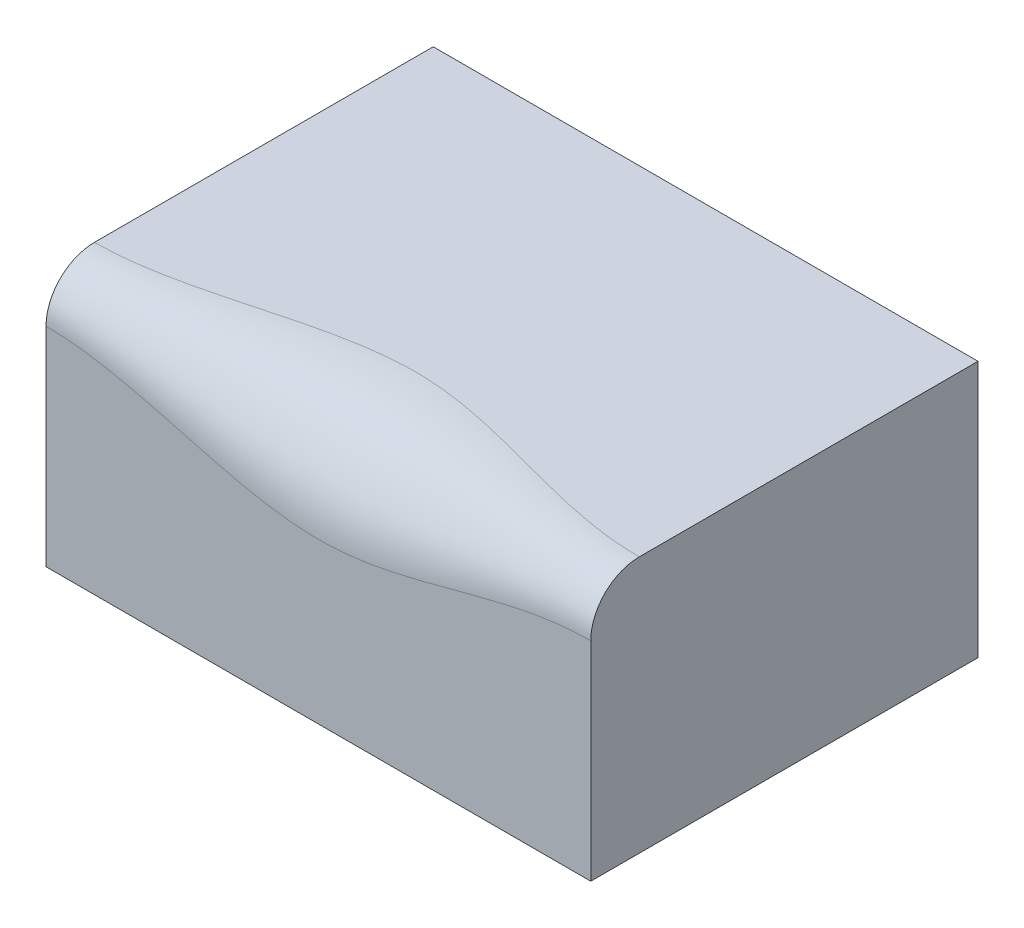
ISO-10303-21;
HEADER;
FILE_DESCRIPTION(('STEP AP214'),'2;1');
FILE_NAME('part.step','',(''),(''),'','','');
FILE_SCHEMA(('AUTOMOTIVE_DESIGN { 1 0 10303 214 1 1 1 1 }'));
ENDSEC;
DATA;
#1=APPLICATION_CONTEXT('core data for automotive mechanical design processes');
#2=APPLICATION_PROTOCOL_DEFINITION('international standard','automotive_design',2000,#1);
#3=PRODUCT_CONTEXT('',#1,'mechanical');
#4=PRODUCT('Part','Part','',(#3));
#5=PRODUCT_RELATED_PRODUCT_CATEGORY('part','',(#4));
#6=PRODUCT_DEFINITION_FORMATION('','',#4);
#7=PRODUCT_DEFINITION_CONTEXT('part definition',#1,'design');
#8=PRODUCT_DEFINITION('design','',#6,#7);
#9=PRODUCT_DEFINITION_SHAPE('','',#8);
#10=(LENGTH_UNIT() NAMED_UNIT(*) SI_UNIT(.MILLI.,.METRE.));
#11=(NAMED_UNIT(*) PLANE_ANGLE_UNIT() SI_UNIT($,.RADIAN.));
#12=(NAMED_UNIT(*) SI_UNIT($,.STERADIAN.) SOLID_ANGLE_UNIT());
#13=UNCERTAINTY_MEASURE_WITH_UNIT(LENGTH_MEASURE(1.E-05),#10,'distance_accuracy_value','');
#14=(GEOMETRIC_REPRESENTATION_CONTEXT(3) GLOBAL_UNCERTAINTY_ASSIGNED_CONTEXT((#13)) GLOBAL_UNIT_ASSIGNED_CONTEXT((#10,
#11,#12)) REPRESENTATION_CONTEXT('',''));
#15=CARTESIAN_POINT('',(0.,0.,0.));
#16=DIRECTION('',(0.,0.,1.));
#17=DIRECTION('',(1.,0.,0.));
#18=AXIS2_PLACEMENT_3D('',#15,#16,#17);
#19=CARTESIAN_POINT('',(0.,67.31,0.));
#20=DIRECTION('',(1.,0.,0.));
#21=DIRECTION('',(0.,0.,-1.));
#22=AXIS2_PLACEMENT_3D('',#19,#20,#21);
#23=PLANE('',#22);
#24=DIRECTION('',(0.,-1.,0.));
#25=VECTOR('',#24,1.);
#26=CARTESIAN_POINT('',(0.,67.31,0.));
#27=LINE('',#26,#25);
#28=CARTESIAN_POINT('',(0.,54.61,0.));
#29=VERTEX_POINT('',#28);
#30=CARTESIAN_POINT('',(0.,0.,0.));
#31=VERTEX_POINT('',#30);
#32=EDGE_CURVE('E122',#29,#31,#27,.T.);
#33=ORIENTED_EDGE('',*,*,#32,.F.);
#34=CARTESIAN_POINT('',(0.,54.61,0.));
#35=CARTESIAN_POINT('',(0.,54.9672009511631,3.84095411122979E-05));
#36=CARTESIAN_POINT('',(0.,55.3243963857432,-0.0150683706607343));
#37=CARTESIAN_POINT('',(0.,56.0362316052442,-0.0752948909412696));
#38=CARTESIAN_POINT('',(0.,56.3908715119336,-0.120413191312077));
#39=CARTESIAN_POINT('',(0.,57.0948197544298,-0.240340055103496));
#40=CARTESIAN_POINT('',(0.,57.4441319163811,-0.315126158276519));
#41=CARTESIAN_POINT('',(0.,58.1352139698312,-0.493844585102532));
#42=CARTESIAN_POINT('',(0.,58.4769839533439,-0.597776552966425));
#43=CARTESIAN_POINT('',(0.,59.150722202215,-0.834109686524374));
#44=CARTESIAN_POINT('',(0.,59.4826856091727,-0.966524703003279));
#45=CARTESIAN_POINT('',(0.,60.1342763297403,-1.25885162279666));
#46=CARTESIAN_POINT('',(0.,60.4539036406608,-1.41876353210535));
#47=CARTESIAN_POINT('',(0.,61.0784950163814,-1.76491725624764));
#48=CARTESIAN_POINT('',(0.,61.3834616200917,-1.95115448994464));
#49=CARTESIAN_POINT('',(0.,61.976621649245,-2.34865486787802));
#50=CARTESIAN_POINT('',(0.,62.2648151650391,-2.5599178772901));
#51=CARTESIAN_POINT('',(0.,62.8223795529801,-3.0059667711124));
#52=CARTESIAN_POINT('',(0.,63.0917506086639,-3.24075242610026));
#53=CARTESIAN_POINT('',(0.,63.6097598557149,-3.73218074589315));
#54=CARTESIAN_POINT('',(0.,63.8583979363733,-3.98882352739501));
#55=CARTESIAN_POINT('',(0.,64.3332200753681,-4.52219456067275));
#56=CARTESIAN_POINT('',(0.,64.5593996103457,-4.79892683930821));
#57=CARTESIAN_POINT('',(0.,64.9876361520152,-5.37045869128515));
#58=CARTESIAN_POINT('',(0.,65.1896935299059,-5.66525798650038));
#59=CARTESIAN_POINT('',(0.,65.5682909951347,-6.27089328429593));
#60=CARTESIAN_POINT('',(0.,65.7448259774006,-6.5817324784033));
#61=CARTESIAN_POINT('',(0.,66.0710757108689,-7.21718020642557));
#62=CARTESIAN_POINT('',(0.,66.2207902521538,-7.5417888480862));
#63=CARTESIAN_POINT('',(0.,66.4922697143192,-8.20232520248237));
#64=CARTESIAN_POINT('',(0.,66.6140477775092,-8.53824750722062));
#65=CARTESIAN_POINT('',(0.,66.8288482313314,-9.21902333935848));
#66=CARTESIAN_POINT('',(0.,66.9218775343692,-9.56387469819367));
#67=CARTESIAN_POINT('',(0.,67.1031202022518,-10.3694565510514));
#68=CARTESIAN_POINT('',(0.,67.1806975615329,-10.8326492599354));
#69=CARTESIAN_POINT('',(0.,67.2582663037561,-11.5311246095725));
#70=CARTESIAN_POINT('',(0.,67.2776563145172,-11.7644291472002));
#71=CARTESIAN_POINT('',(0.,67.3035233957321,-12.231803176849));
#72=CARTESIAN_POINT('',(0.,67.3099977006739,-12.4658728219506));
#73=CARTESIAN_POINT('',(0.,67.31,-12.7));
#74=B_SPLINE_CURVE_WITH_KNOTS('',3,(#34,#35,#36,#37,#38,#39,#40,#41,#42,#43,#44,#45,#46,#47,#48,
#49,#50,#51,#52,#53,#54,#55,#56,#57,#58,#59,#60,#61,#62,#63,#64,#65,#66,#67,#68,#69,#70,#71,#72,
#73),.UNSPECIFIED.,.F.,.F.,(4,2,2,2,2,2,2,2,2,2,2,2,2,2,2,2,2,2,2,4),(0.,1.07127576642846,
2.14250014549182,3.21291508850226,4.28331696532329,5.35424054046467,6.42516434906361,
7.49590202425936,8.56663393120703,9.6373553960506,10.7080825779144,11.7790249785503,
12.8499508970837,13.9210907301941,14.9922389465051,16.062882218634,17.1332678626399,
18.5389324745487,19.2409593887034,19.943136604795),.UNSPECIFIED.);
#75=CARTESIAN_POINT('',(0.,67.31,-12.7));
#76=VERTEX_POINT('',#75);
#77=EDGE_CURVE('E12',#29,#76,#74,.T.);
#78=ORIENTED_EDGE('',*,*,#77,.T.);
#79=DIRECTION('',(0.,0.,1.));
#80=VECTOR('',#79,1.);
#81=CARTESIAN_POINT('',(0.,67.31,0.));
#82=LINE('',#81,#80);
#83=CARTESIAN_POINT('',(0.,67.31,-101.537865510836));
#84=VERTEX_POINT('',#83);
#85=EDGE_CURVE('E93',#84,#76,#82,.T.);
#86=ORIENTED_EDGE('',*,*,#85,.F.);
#87=DIRECTION('',(0.,-1.,0.));
#88=VECTOR('',#87,1.);
#89=CARTESIAN_POINT('',(0.,67.31,-101.537865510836));
#90=LINE('',#89,#88);
#91=CARTESIAN_POINT('',(0.,0.,-101.537865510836));
#92=VERTEX_POINT('',#91);
#93=EDGE_CURVE('E103',#84,#92,#90,.T.);
#94=ORIENTED_EDGE('',*,*,#93,.T.);
#95=DIRECTION('',(0.,0.,1.));
#96=VECTOR('',#95,1.);
#97=CARTESIAN_POINT('',(0.,0.,0.));
#98=LINE('',#97,#96);
#99=EDGE_CURVE('E112',#92,#31,#98,.T.);
#100=ORIENTED_EDGE('',*,*,#99,.T.);
#101=EDGE_LOOP('',(#33,#78,#86,#94,#100));
#102=FACE_BOUND('',#101,.T.);
#103=ADVANCED_FACE('F34',(#102),#23,.F.);
#104=CARTESIAN_POINT('',(0.,67.31,0.));
#105=DIRECTION('',(0.,0.,-1.));
#106=DIRECTION('',(-1.,0.,0.));
#107=AXIS2_PLACEMENT_3D('',#104,#105,#106);
#108=PLANE('',#107);
#109=DIRECTION('',(0.,-1.,0.));
#110=VECTOR('',#109,1.);
#111=CARTESIAN_POINT('',(142.851266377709,67.31,0.));
#112=LINE('',#111,#110);
#113=CARTESIAN_POINT('',(142.851266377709,54.61,0.));
#114=VERTEX_POINT('',#113);
#115=CARTESIAN_POINT('',(142.851266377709,0.,0.));
#116=VERTEX_POINT('',#115);
#117=EDGE_CURVE('E102',#114,#116,#112,.T.);
#118=ORIENTED_EDGE('',*,*,#117,.F.);
#119=CARTESIAN_POINT('',(-285.702532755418,54.61,0.));
#120=CARTESIAN_POINT('',(-190.468355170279,54.61,0.));
#121=CARTESIAN_POINT('',(-95.2341775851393,54.61,0.));
#122=CARTESIAN_POINT('',(0.,54.61,0.));
#123=CARTESIAN_POINT('',(23.8085443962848,54.61,0.));
#124=CARTESIAN_POINT('',(47.6170887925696,41.91,0.));
#125=CARTESIAN_POINT('',(71.4256331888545,41.91,0.));
#126=CARTESIAN_POINT('',(95.2341775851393,41.91,0.));
#127=CARTESIAN_POINT('',(119.042721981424,54.61,0.));
#128=CARTESIAN_POINT('',(142.851266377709,54.61,0.));
#129=CARTESIAN_POINT('',(238.085443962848,54.61,0.));
#130=CARTESIAN_POINT('',(333.319621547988,54.61,0.));
#131=CARTESIAN_POINT('',(428.553799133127,54.61,0.));
#132=(BOUNDED_CURVE() B_SPLINE_CURVE(3,(#119,#120,#121,#122,#123,#124,#125,#126,#127,#128,#129,
#130,#131),.UNSPECIFIED.,.F.,.F.) B_SPLINE_CURVE_WITH_KNOTS((4,3,3,3,4),(0.,0.4,0.5,0.6,1.),
.UNSPECIFIED.) CURVE() GEOMETRIC_REPRESENTATION_ITEM() RATIONAL_B_SPLINE_CURVE((1.,1.,1.,1.,1.,
1.,1.,1.,1.,1.,1.,1.,1.)) REPRESENTATION_ITEM(''));
#133=EDGE_CURVE('E48',#114,#29,#132,.F.);
#134=ORIENTED_EDGE('',*,*,#133,.T.);
#135=ORIENTED_EDGE('',*,*,#32,.T.);
#136=DIRECTION('',(1.,0.,0.));
#137=VECTOR('',#136,1.);
#138=CARTESIAN_POINT('',(0.,0.,0.));
#139=LINE('',#138,#137);
#140=EDGE_CURVE('E115',#31,#116,#139,.T.);
#141=ORIENTED_EDGE('',*,*,#140,.T.);
#142=EDGE_LOOP('',(#118,#134,#135,#141));
#143=FACE_BOUND('',#142,.T.);
#144=ADVANCED_FACE('F140',(#143),#108,.F.);
#145=CARTESIAN_POINT('',(142.851266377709,67.31,0.));
#146=DIRECTION('',(-1.,0.,0.));
#147=DIRECTION('',(0.,0.,1.));
#148=AXIS2_PLACEMENT_3D('',#145,#146,#147);
#149=PLANE('',#148);
#150=DIRECTION('',(0.,0.,-1.));
#151=VECTOR('',#150,1.);
#152=CARTESIAN_POINT('',(142.851266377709,67.31,0.));
#153=LINE('',#152,#151);
#154=CARTESIAN_POINT('',(142.851266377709,67.31,-12.7));
#155=VERTEX_POINT('',#154);
#156=CARTESIAN_POINT('',(142.851266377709,67.31,-101.537865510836));
#157=VERTEX_POINT('',#156);
#158=EDGE_CURVE('E84',#155,#157,#153,.T.);
#159=ORIENTED_EDGE('',*,*,#158,.F.);
#160=CARTESIAN_POINT('',(142.851266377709,67.31,-12.7));
#161=CARTESIAN_POINT('',(142.851266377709,67.3100384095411,-12.3427990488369));
#162=CARTESIAN_POINT('',(142.851266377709,67.2949316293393,-11.9856036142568));
#163=CARTESIAN_POINT('',(142.851266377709,67.2347051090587,-11.2737683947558));
#164=CARTESIAN_POINT('',(142.851266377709,67.1895868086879,-10.9191284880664));
#165=CARTESIAN_POINT('',(142.851266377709,67.0696599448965,-10.2151802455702));
#166=CARTESIAN_POINT('',(142.851266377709,66.9948738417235,-9.86586808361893));
#167=CARTESIAN_POINT('',(142.851266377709,66.8161554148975,-9.17478603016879));
#168=CARTESIAN_POINT('',(142.851266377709,66.7122234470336,-8.83301604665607));
#169=CARTESIAN_POINT('',(142.851266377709,66.4758903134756,-8.15927779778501));
#170=CARTESIAN_POINT('',(142.851266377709,66.3434752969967,-7.82731439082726));
#171=CARTESIAN_POINT('',(142.851266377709,66.0511483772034,-7.17572367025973));
#172=CARTESIAN_POINT('',(142.851266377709,65.8912364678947,-6.85609635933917));
#173=CARTESIAN_POINT('',(142.851266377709,65.5450827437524,-6.23150498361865));
#174=CARTESIAN_POINT('',(142.851266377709,65.3588455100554,-5.92653837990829));
#175=CARTESIAN_POINT('',(142.851266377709,64.961345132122,-5.33337835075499));
#176=CARTESIAN_POINT('',(142.851266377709,64.7500821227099,-5.0451848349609));
#177=CARTESIAN_POINT('',(142.851266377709,64.3040332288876,-4.48762044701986));
#178=CARTESIAN_POINT('',(142.851266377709,64.0692475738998,-4.21824939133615));
#179=CARTESIAN_POINT('',(142.851266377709,63.5778192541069,-3.70024014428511));
#180=CARTESIAN_POINT('',(142.851266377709,63.321176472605,-3.45160206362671));
#181=CARTESIAN_POINT('',(142.851266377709,62.7878054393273,-2.97677992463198));
#182=CARTESIAN_POINT('',(142.851266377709,62.5110731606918,-2.7506003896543));
#183=CARTESIAN_POINT('',(142.851266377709,61.9395413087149,-2.32236384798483));
#184=CARTESIAN_POINT('',(142.851266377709,61.6447420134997,-2.12030647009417));
#185=CARTESIAN_POINT('',(142.851266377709,61.0391067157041,-1.74170900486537));
#186=CARTESIAN_POINT('',(142.851266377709,60.7282675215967,-1.56517402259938));
#187=CARTESIAN_POINT('',(142.851266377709,60.0928197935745,-1.23892428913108));
#188=CARTESIAN_POINT('',(142.851266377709,59.7682111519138,-1.08920974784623));
#189=CARTESIAN_POINT('',(142.851266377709,59.1076747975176,-0.817730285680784));
#190=CARTESIAN_POINT('',(142.851266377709,58.7717524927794,-0.695952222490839));
#191=CARTESIAN_POINT('',(142.851266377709,58.0909766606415,-0.481151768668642));
#192=CARTESIAN_POINT('',(142.851266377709,57.7461253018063,-0.388122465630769));
#193=CARTESIAN_POINT('',(142.851266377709,56.9405434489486,-0.206879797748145));
#194=CARTESIAN_POINT('',(142.851266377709,56.4773507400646,-0.129302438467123));
#195=CARTESIAN_POINT('',(142.851266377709,55.7788753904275,-0.0517336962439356));
#196=CARTESIAN_POINT('',(142.851266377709,55.5455708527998,-0.0323436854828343));
#197=CARTESIAN_POINT('',(142.851266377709,55.078196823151,-0.00647660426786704));
#198=CARTESIAN_POINT('',(142.851266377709,54.8441271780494,-2.29932605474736E-06));
#199=CARTESIAN_POINT('',(142.851266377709,54.61,0.));
#200=B_SPLINE_CURVE_WITH_KNOTS('',3,(#160,#161,#162,#163,#164,#165,#166,#167,#168,#169,#170,
#171,#172,#173,#174,#175,#176,#177,#178,#179,#180,#181,#182,#183,#184,#185,#186,#187,#188,#189,
#190,#191,#192,#193,#194,#195,#196,#197,#198,#199),.UNSPECIFIED.,.F.,.F.,(4,2,2,2,2,2,2,2,2,2,2,
2,2,2,2,2,2,2,2,4),(0.,1.07127576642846,2.14250014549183,3.21291508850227,4.2833169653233,
5.35424054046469,6.42516434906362,7.49590202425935,8.56663393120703,9.63735539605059,
10.7080825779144,11.7790249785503,12.8499508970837,13.9210907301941,14.9922389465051,
16.062882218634,17.13326786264,18.5389324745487,19.2409593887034,19.943136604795),.UNSPECIFIED.);
#201=EDGE_CURVE('E62',#155,#114,#200,.T.);
#202=ORIENTED_EDGE('',*,*,#201,.T.);
#203=ORIENTED_EDGE('',*,*,#117,.T.);
#204=DIRECTION('',(0.,0.,-1.));
#205=VECTOR('',#204,1.);
#206=CARTESIAN_POINT('',(142.851266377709,0.,0.));
#207=LINE('',#206,#205);
#208=CARTESIAN_POINT('',(142.851266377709,0.,-101.537865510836));
#209=VERTEX_POINT('',#208);
#210=EDGE_CURVE('E99',#116,#209,#207,.T.);
#211=ORIENTED_EDGE('',*,*,#210,.T.);
#212=DIRECTION('',(0.,-1.,0.));
#213=VECTOR('',#212,1.);
#214=CARTESIAN_POINT('',(142.851266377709,67.31,-101.537865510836));
#215=LINE('',#214,#213);
#216=EDGE_CURVE('E96',#157,#209,#215,.T.);
#217=ORIENTED_EDGE('',*,*,#216,.F.);
#218=EDGE_LOOP('',(#159,#202,#203,#211,#217));
#219=FACE_BOUND('',#218,.T.);
#220=ADVANCED_FACE('F97',(#219),#149,.F.);
#221=CARTESIAN_POINT('',(0.,67.31,-101.537865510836));
#222=DIRECTION('',(0.,0.,1.));
#223=DIRECTION('',(1.,0.,0.));
#224=AXIS2_PLACEMENT_3D('',#221,#222,#223);
#225=PLANE('',#224);
#226=DIRECTION('',(-1.,0.,0.));
#227=VECTOR('',#226,1.);
#228=CARTESIAN_POINT('',(0.,0.,-101.537865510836));
#229=LINE('',#228,#227);
#230=EDGE_CURVE('E119',#209,#92,#229,.T.);
#231=ORIENTED_EDGE('',*,*,#230,.T.);
#232=ORIENTED_EDGE('',*,*,#93,.F.);
#233=DIRECTION('',(-1.,0.,0.));
#234=VECTOR('',#233,1.);
#235=CARTESIAN_POINT('',(0.,67.31,-101.537865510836));
#236=LINE('',#235,#234);
#237=EDGE_CURVE('E89',#157,#84,#236,.T.);
#238=ORIENTED_EDGE('',*,*,#237,.F.);
#239=ORIENTED_EDGE('',*,*,#216,.T.);
#240=EDGE_LOOP('',(#231,#232,#238,#239));
#241=FACE_BOUND('',#240,.T.);
#242=ADVANCED_FACE('F105',(#241),#225,.F.);
#243=CARTESIAN_POINT('',(0.,67.31,-101.537865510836));
#244=DIRECTION('',(0.,-1.,0.));
#245=DIRECTION('',(0.,0.,-1.));
#246=AXIS2_PLACEMENT_3D('',#243,#244,#245);
#247=PLANE('',#246);
#248=ORIENTED_EDGE('',*,*,#85,.T.);
#249=CARTESIAN_POINT('',(-285.702532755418,67.31,-12.7));
#250=CARTESIAN_POINT('',(-190.468355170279,67.31,-12.7));
#251=CARTESIAN_POINT('',(-95.2341775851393,67.31,-12.7));
#252=CARTESIAN_POINT('',(0.,67.31,-12.7));
#253=CARTESIAN_POINT('',(23.8085443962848,67.31,-12.7));
#254=CARTESIAN_POINT('',(47.6170887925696,67.31,-25.4));
#255=CARTESIAN_POINT('',(71.4256331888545,67.31,-25.4));
#256=CARTESIAN_POINT('',(95.2341775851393,67.31,-25.4));
#257=CARTESIAN_POINT('',(119.042721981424,67.31,-12.7));
#258=CARTESIAN_POINT('',(142.851266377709,67.31,-12.7));
#259=CARTESIAN_POINT('',(238.085443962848,67.31,-12.7));
#260=CARTESIAN_POINT('',(333.319621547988,67.31,-12.7));
#261=CARTESIAN_POINT('',(428.553799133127,67.31,-12.7));
#262=(BOUNDED_CURVE() B_SPLINE_CURVE(3,(#249,#250,#251,#252,#253,#254,#255,#256,#257,#258,#259,
#260,#261),.UNSPECIFIED.,.F.,.F.) B_SPLINE_CURVE_WITH_KNOTS((4,3,3,3,4),(0.,0.4,0.5,0.6,1.),
.UNSPECIFIED.) CURVE() GEOMETRIC_REPRESENTATION_ITEM() RATIONAL_B_SPLINE_CURVE((1.,1.,1.,1.,1.,
1.,1.,1.,1.,1.,1.,1.,1.)) REPRESENTATION_ITEM(''));
#263=EDGE_CURVE('E92',#76,#155,#262,.T.);
#264=ORIENTED_EDGE('',*,*,#263,.T.);
#265=ORIENTED_EDGE('',*,*,#158,.T.);
#266=ORIENTED_EDGE('',*,*,#237,.T.);
#267=EDGE_LOOP('',(#248,#264,#265,#266));
#268=FACE_BOUND('',#267,.T.);
#269=ADVANCED_FACE('F87',(#268),#247,.F.);
#270=CARTESIAN_POINT('',(0.,0.,-101.537865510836));
#271=DIRECTION('',(0.,-1.,0.));
#272=DIRECTION('',(0.,0.,-1.));
#273=AXIS2_PLACEMENT_3D('',#270,#271,#272);
#274=PLANE('',#273);
#275=ORIENTED_EDGE('',*,*,#99,.F.);
#276=ORIENTED_EDGE('',*,*,#230,.F.);
#277=ORIENTED_EDGE('',*,*,#210,.F.);
#278=ORIENTED_EDGE('',*,*,#140,.F.);
#279=EDGE_LOOP('',(#275,#276,#277,#278));
#280=FACE_BOUND('',#279,.T.);
#281=ADVANCED_FACE('F153',(#280),#274,.T.);
#282=CARTESIAN_POINT('',(-28.5702532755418,67.31,-12.7));
#283=CARTESIAN_POINT('',(-19.0468355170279,67.31,-12.7));
#284=CARTESIAN_POINT('',(-9.52341775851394,67.31,-12.7));
#285=CARTESIAN_POINT('',(0.,67.31,-12.7));
#286=CARTESIAN_POINT('',(23.8085443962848,67.31,-12.7));
#287=CARTESIAN_POINT('',(47.6170887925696,67.31,-25.4));
#288=CARTESIAN_POINT('',(71.4256331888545,67.31,-25.4));
#289=CARTESIAN_POINT('',(95.2341775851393,67.31,-25.4));
#290=CARTESIAN_POINT('',(119.042721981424,67.31,-12.7));
#291=CARTESIAN_POINT('',(142.851266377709,67.31,-12.7));
#292=CARTESIAN_POINT('',(152.374684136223,67.31,-12.7));
#293=CARTESIAN_POINT('',(161.898101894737,67.31,-12.7));
#294=CARTESIAN_POINT('',(171.421519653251,67.31,-12.7));
#295=CARTESIAN_POINT('',(-28.5702532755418,67.31,0.));
#296=CARTESIAN_POINT('',(-19.0468355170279,67.31,0.));
#297=CARTESIAN_POINT('',(-9.52341775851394,67.31,0.));
#298=CARTESIAN_POINT('',(0.,67.31,0.));
#299=CARTESIAN_POINT('',(23.8085443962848,67.31,0.));
#300=CARTESIAN_POINT('',(47.6170887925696,67.31,0.));
#301=CARTESIAN_POINT('',(71.4256331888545,67.31,0.));
#302=CARTESIAN_POINT('',(95.2341775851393,67.31,0.));
#303=CARTESIAN_POINT('',(119.042721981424,67.31,0.));
#304=CARTESIAN_POINT('',(142.851266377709,67.31,0.));
#305=CARTESIAN_POINT('',(152.374684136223,67.31,0.));
#306=CARTESIAN_POINT('',(161.898101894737,67.31,0.));
#307=CARTESIAN_POINT('',(171.421519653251,67.31,0.));
#308=CARTESIAN_POINT('',(-28.5702532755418,54.61,0.));
#309=CARTESIAN_POINT('',(-19.0468355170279,54.61,0.));
#310=CARTESIAN_POINT('',(-9.52341775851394,54.61,0.));
#311=CARTESIAN_POINT('',(0.,54.61,0.));
#312=CARTESIAN_POINT('',(23.8085443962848,54.61,0.));
#313=CARTESIAN_POINT('',(47.6170887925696,41.91,0.));
#314=CARTESIAN_POINT('',(71.4256331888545,41.91,0.));
#315=CARTESIAN_POINT('',(95.2341775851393,41.91,0.));
#316=CARTESIAN_POINT('',(119.042721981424,54.61,0.));
#317=CARTESIAN_POINT('',(142.851266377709,54.61,0.));
#318=CARTESIAN_POINT('',(152.374684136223,54.61,0.));
#319=CARTESIAN_POINT('',(161.898101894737,54.61,0.));
#320=CARTESIAN_POINT('',(171.421519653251,54.61,0.));
#321=(BOUNDED_SURFACE() B_SPLINE_SURFACE(2,3,((#282,#283,#284,#285,#286,#287,#288,#289,#290,
#291,#292,#293,#294),(#295,#296,#297,#298,#299,#300,#301,#302,#303,#304,#305,#306,#307),(#308,
#309,#310,#311,#312,#313,#314,#315,#316,#317,#318,#319,#320)),.UNSPECIFIED.,.F.,.F.,
.F.) B_SPLINE_SURFACE_WITH_KNOTS((3,3),(4,3,3,3,4),(0.,1.),(0.36,0.4,0.5,0.6,0.64),
.UNSPECIFIED.) GEOMETRIC_REPRESENTATION_ITEM() RATIONAL_B_SPLINE_SURFACE(((1.,1.,1.,1.,1.,1.,1.,
1.,1.,1.,1.,1.,1.),(0.707106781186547,0.707106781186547,0.707106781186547,0.707106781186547,
0.707106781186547,0.707106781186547,0.707106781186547,0.707106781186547,0.707106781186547,
0.707106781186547,0.707106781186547,0.707106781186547,0.707106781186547),(1.,1.,1.,1.,1.,1.,1.,
1.,1.,1.,1.,1.,1.))) REPRESENTATION_ITEM('') SURFACE());
#322=ORIENTED_EDGE('',*,*,#77,.F.);
#323=ORIENTED_EDGE('',*,*,#133,.F.);
#324=ORIENTED_EDGE('',*,*,#201,.F.);
#325=ORIENTED_EDGE('',*,*,#263,.F.);
#326=EDGE_LOOP('',(#322,#323,#324,#325));
#327=FACE_BOUND('',#326,.T.);
#328=ADVANCED_FACE('F36',(#327),#321,.T.);
#329=CLOSED_SHELL('',(#103,#144,#220,#242,#269,#281,#328));
#330=MANIFOLD_SOLID_BREP('B2',#329);
#331=ADVANCED_BREP_SHAPE_REPRESENTATION('',(#18,#330),#14);
#332=SHAPE_DEFINITION_REPRESENTATION(#9,#331);
ENDSEC;
END-ISO-10303-21;
